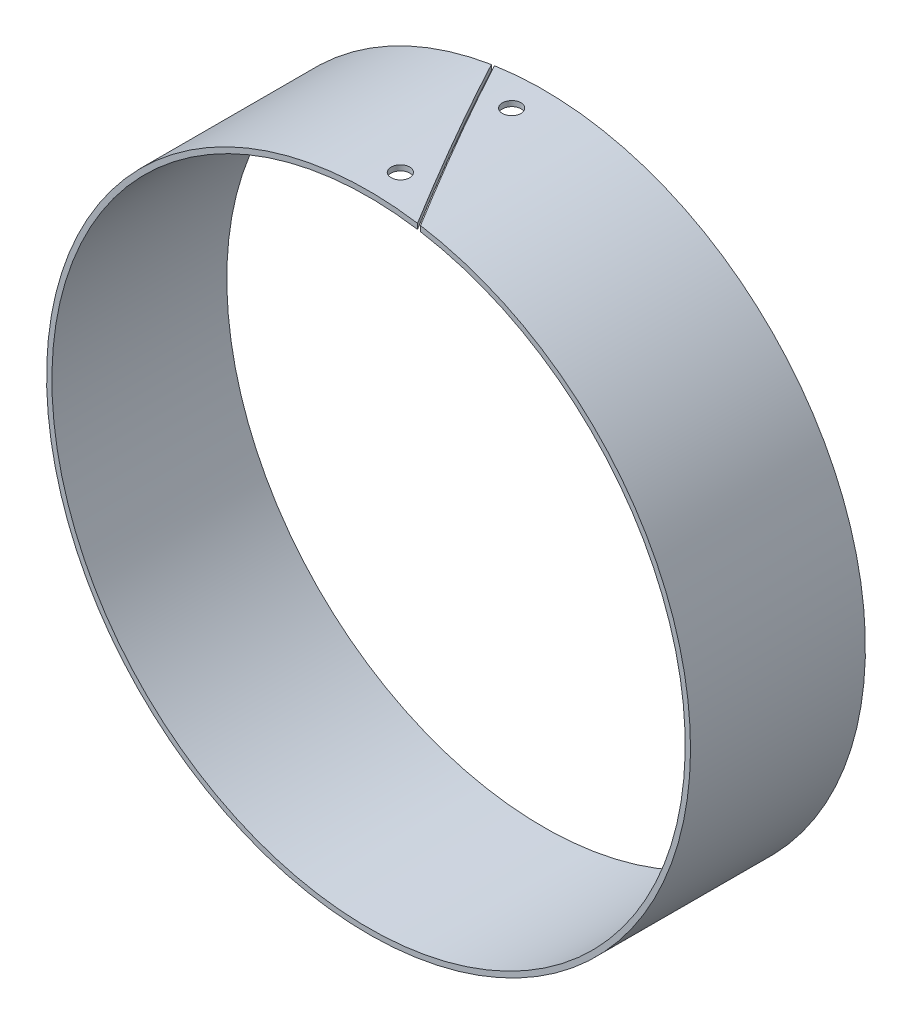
ISO-10303-21;
HEADER;
FILE_DESCRIPTION(('STEP AP214'),'2;1');
FILE_NAME('part.step','',(''),(''),'','','');
FILE_SCHEMA(('AUTOMOTIVE_DESIGN { 1 0 10303 214 1 1 1 1 }'));
ENDSEC;
DATA;
#1=APPLICATION_CONTEXT('core data for automotive mechanical design processes');
#2=APPLICATION_PROTOCOL_DEFINITION('international standard','automotive_design',2000,#1);
#3=PRODUCT_CONTEXT('',#1,'mechanical');
#4=PRODUCT('Part','Part','',(#3));
#5=PRODUCT_RELATED_PRODUCT_CATEGORY('part','',(#4));
#6=PRODUCT_DEFINITION_FORMATION('','',#4);
#7=PRODUCT_DEFINITION_CONTEXT('part definition',#1,'design');
#8=PRODUCT_DEFINITION('design','',#6,#7);
#9=PRODUCT_DEFINITION_SHAPE('','',#8);
#10=(LENGTH_UNIT() NAMED_UNIT(*) SI_UNIT(.MILLI.,.METRE.));
#11=(NAMED_UNIT(*) PLANE_ANGLE_UNIT() SI_UNIT($,.RADIAN.));
#12=(NAMED_UNIT(*) SI_UNIT($,.STERADIAN.) SOLID_ANGLE_UNIT());
#13=UNCERTAINTY_MEASURE_WITH_UNIT(LENGTH_MEASURE(1.E-05),#10,'distance_accuracy_value','');
#14=(GEOMETRIC_REPRESENTATION_CONTEXT(3) GLOBAL_UNCERTAINTY_ASSIGNED_CONTEXT((#13)) GLOBAL_UNIT_ASSIGNED_CONTEXT((#10,
#11,#12)) REPRESENTATION_CONTEXT('',''));
#15=CARTESIAN_POINT('',(0.,0.,0.));
#16=DIRECTION('',(0.,0.,1.));
#17=DIRECTION('',(1.,0.,0.));
#18=AXIS2_PLACEMENT_3D('',#15,#16,#17);
#19=CARTESIAN_POINT('',(0.,0.,32.9999999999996));
#20=DIRECTION('',(0.,0.,1.));
#21=DIRECTION('',(1.,0.,0.));
#22=AXIS2_PLACEMENT_3D('',#19,#20,#21);
#23=PLANE('',#22);
#24=DIRECTION('',(0.,1.,0.));
#25=VECTOR('',#24,1.);
#26=CARTESIAN_POINT('',(9.23520861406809,43.,33.));
#27=LINE('',#26,#25);
#28=CARTESIAN_POINT('',(9.23520861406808,59.0319694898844,33.));
#29=VERTEX_POINT('',#28);
#30=CARTESIAN_POINT('',(9.23520861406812,60.0439291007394,33.));
#31=VERTEX_POINT('',#30);
#32=EDGE_CURVE('E39',#29,#31,#27,.T.);
#33=ORIENTED_EDGE('',*,*,#32,.T.);
#34=CARTESIAN_POINT('',(0.,0.,32.9999999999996));
#35=DIRECTION('',(0.,0.,1.));
#36=DIRECTION('',(1.,0.,0.));
#37=AXIS2_PLACEMENT_3D('',#34,#35,#36);
#38=CIRCLE('',#37,60.75);
#39=CARTESIAN_POINT('',(9.81255888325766,59.9522825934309,33.));
#40=VERTEX_POINT('',#39);
#41=EDGE_CURVE('E62',#31,#40,#38,.T.);
#42=ORIENTED_EDGE('',*,*,#41,.T.);
#43=DIRECTION('',(0.,1.,0.));
#44=VECTOR('',#43,1.);
#45=CARTESIAN_POINT('',(9.81255888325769,43.,33.));
#46=LINE('',#45,#44);
#47=CARTESIAN_POINT('',(9.81255888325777,58.9387494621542,33.));
#48=VERTEX_POINT('',#47);
#49=EDGE_CURVE('E56',#48,#40,#46,.T.);
#50=ORIENTED_EDGE('',*,*,#49,.F.);
#51=CARTESIAN_POINT('',(0.,0.,32.9999999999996));
#52=DIRECTION('',(0.,0.,1.));
#53=DIRECTION('',(1.,0.,0.));
#54=AXIS2_PLACEMENT_3D('',#51,#52,#53);
#55=CIRCLE('',#54,59.75);
#56=EDGE_CURVE('E66',#29,#48,#55,.T.);
#57=ORIENTED_EDGE('',*,*,#56,.F.);
#58=EDGE_LOOP('',(#33,#42,#50,#57));
#59=FACE_BOUND('',#58,.T.);
#60=ADVANCED_FACE('F16',(#59),#23,.T.);
#61=CARTESIAN_POINT('',(0.,0.,0.));
#62=DIRECTION('',(0.,0.,1.));
#63=DIRECTION('',(1.,0.,0.));
#64=AXIS2_PLACEMENT_3D('',#61,#62,#63);
#65=PLANE('',#64);
#66=CARTESIAN_POINT('',(0.,0.,0.));
#67=DIRECTION('',(0.,0.,1.));
#68=DIRECTION('',(1.,0.,0.));
#69=AXIS2_PLACEMENT_3D('',#66,#67,#68);
#70=CIRCLE('',#69,60.75);
#71=CARTESIAN_POINT('',(-9.81735026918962,59.9514981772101,-1.38777878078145E-13));
#72=VERTEX_POINT('',#71);
#73=CARTESIAN_POINT('',(-9.24,60.0431919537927,0.));
#74=VERTEX_POINT('',#73);
#75=EDGE_CURVE('E71',#72,#74,#70,.T.);
#76=ORIENTED_EDGE('',*,*,#75,.F.);
#77=DIRECTION('',(0.,1.,0.));
#78=VECTOR('',#77,1.);
#79=CARTESIAN_POINT('',(-9.81735026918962,43.,-1.38777878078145E-13));
#80=LINE('',#79,#78);
#81=CARTESIAN_POINT('',(-9.81735026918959,58.9379515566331,-1.38777878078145E-13));
#82=VERTEX_POINT('',#81);
#83=EDGE_CURVE('E120',#82,#72,#80,.T.);
#84=ORIENTED_EDGE('',*,*,#83,.F.);
#85=CARTESIAN_POINT('',(0.,0.,0.));
#86=DIRECTION('',(0.,0.,1.));
#87=DIRECTION('',(1.,0.,0.));
#88=AXIS2_PLACEMENT_3D('',#85,#86,#87);
#89=CIRCLE('',#88,59.75);
#90=CARTESIAN_POINT('',(-9.24,59.0312197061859,0.));
#91=VERTEX_POINT('',#90);
#92=EDGE_CURVE('E72',#82,#91,#89,.T.);
#93=ORIENTED_EDGE('',*,*,#92,.T.);
#94=DIRECTION('',(0.,1.,0.));
#95=VECTOR('',#94,1.);
#96=CARTESIAN_POINT('',(-9.24,43.,0.));
#97=LINE('',#96,#95);
#98=EDGE_CURVE('E32',#91,#74,#97,.T.);
#99=ORIENTED_EDGE('',*,*,#98,.T.);
#100=EDGE_LOOP('',(#76,#84,#93,#99));
#101=FACE_BOUND('',#100,.T.);
#102=ADVANCED_FACE('F125',(#101),#65,.F.);
#103=CARTESIAN_POINT('',(0.,0.,32.9999999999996));
#104=DIRECTION('',(0.,0.,-1.));
#105=DIRECTION('',(-1.,0.,0.));
#106=AXIS2_PLACEMENT_3D('',#103,#104,#105);
#107=CYLINDRICAL_SURFACE('',#106,60.75);
#108=CARTESIAN_POINT('',(0.,60.75,7.75));
#109=CARTESIAN_POINT('',(-0.0982763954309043,60.7499996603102,7.7499956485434));
#110=CARTESIAN_POINT('',(-0.196623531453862,60.7497589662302,7.74169371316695));
#111=CARTESIAN_POINT('',(-0.390607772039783,60.7488219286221,7.70869169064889));
#112=CARTESIAN_POINT('',(-0.486241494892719,60.7481250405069,7.68397200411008));
#113=CARTESIAN_POINT('',(-0.671960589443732,60.7463545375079,7.61884012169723));
#114=CARTESIAN_POINT('',(-0.762048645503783,60.7452811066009,7.57843558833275));
#115=CARTESIAN_POINT('',(-0.934138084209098,60.7428786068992,7.48309190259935));
#116=CARTESIAN_POINT('',(-1.01614143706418,60.7415496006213,7.42815630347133));
#117=CARTESIAN_POINT('',(-1.16979435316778,60.7387849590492,7.30528195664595));
#118=CARTESIAN_POINT('',(-1.24144014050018,60.7373492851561,7.23733848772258));
#119=CARTESIAN_POINT('',(-1.37231244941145,60.734533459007,7.09038516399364));
#120=CARTESIAN_POINT('',(-1.43153847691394,60.7331533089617,7.01137486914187));
#121=CARTESIAN_POINT('',(-1.53589546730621,60.7306039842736,6.84451731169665));
#122=CARTESIAN_POINT('',(-1.58102423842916,60.7294348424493,6.7566686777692));
#123=CARTESIAN_POINT('',(-1.65589137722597,60.7274397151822,6.57463793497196));
#124=CARTESIAN_POINT('',(-1.68562980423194,60.7266137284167,6.48045585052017));
#125=CARTESIAN_POINT('',(-1.72886417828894,60.7253983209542,6.28845951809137));
#126=CARTESIAN_POINT('',(-1.74236466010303,60.7250087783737,6.19064629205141));
#127=CARTESIAN_POINT('',(-1.75275388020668,60.7247098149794,5.99414112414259));
#128=CARTESIAN_POINT('',(-1.74964268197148,60.7248003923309,5.89544918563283));
#129=CARTESIAN_POINT('',(-1.7269007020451,60.7254513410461,5.70001886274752));
#130=CARTESIAN_POINT('',(-1.70727482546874,60.7260115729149,5.60327990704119));
#131=CARTESIAN_POINT('',(-1.65206818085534,60.7275384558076,5.41447034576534));
#132=CARTESIAN_POINT('',(-1.6164873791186,60.72850510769,5.3223997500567));
#133=CARTESIAN_POINT('',(-1.5303752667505,60.7307360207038,5.14552470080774));
#134=CARTESIAN_POINT('',(-1.47984170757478,60.7320003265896,5.06072134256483));
#135=CARTESIAN_POINT('',(-1.36526022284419,60.7346839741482,4.90080005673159));
#136=CARTESIAN_POINT('',(-1.30121226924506,60.7361033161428,4.82568214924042));
#137=CARTESIAN_POINT('',(-1.16139233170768,60.7389376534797,4.6872355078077));
#138=CARTESIAN_POINT('',(-1.08561609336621,60.740352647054,4.62391107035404));
#139=CARTESIAN_POINT('',(-0.924505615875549,60.7430182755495,4.51088200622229));
#140=CARTESIAN_POINT('',(-0.839171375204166,60.7442689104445,4.46117738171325));
#141=CARTESIAN_POINT('',(-0.661364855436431,60.7464648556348,4.37679937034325));
#142=CARTESIAN_POINT('',(-0.568892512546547,60.7474101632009,4.34212611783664));
#143=CARTESIAN_POINT('',(-0.379435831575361,60.7488888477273,4.28879784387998));
#144=CARTESIAN_POINT('',(-0.282451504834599,60.7494222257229,4.27014278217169));
#145=CARTESIAN_POINT('',(-0.0867612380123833,60.7500167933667,4.24938570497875));
#146=CARTESIAN_POINT('',(0.0119440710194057,60.7500781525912,4.24727774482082));
#147=CARTESIAN_POINT('',(0.208307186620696,60.7497222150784,4.25965921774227));
#148=CARTESIAN_POINT('',(0.305964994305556,60.7493049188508,4.27414863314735));
#149=CARTESIAN_POINT('',(0.497444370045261,60.7480388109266,4.31930863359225));
#150=CARTESIAN_POINT('',(0.591266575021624,60.7471900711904,4.34997652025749));
#151=CARTESIAN_POINT('',(0.772431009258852,60.7451567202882,4.42662016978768));
#152=CARTESIAN_POINT('',(0.859773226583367,60.7439721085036,4.47259596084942));
#153=CARTESIAN_POINT('',(1.02552571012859,60.7414000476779,4.57856563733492));
#154=CARTESIAN_POINT('',(1.10393341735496,60.7400125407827,4.63856352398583));
#155=CARTESIAN_POINT('',(1.24956546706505,60.7371912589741,4.7708683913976));
#156=CARTESIAN_POINT('',(1.31678978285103,60.7357574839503,4.84317540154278));
#157=CARTESIAN_POINT('',(1.43816662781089,60.7330048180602,4.99807144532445));
#158=CARTESIAN_POINT('',(1.49231532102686,60.7316859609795,5.08066348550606));
#159=CARTESIAN_POINT('',(1.58597759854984,60.7293123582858,5.25376973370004));
#160=CARTESIAN_POINT('',(1.62549121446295,60.7282576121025,5.3442839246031));
#161=CARTESIAN_POINT('',(1.68875497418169,60.7265313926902,5.53065065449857));
#162=CARTESIAN_POINT('',(1.71250760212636,60.7258598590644,5.6265023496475));
#163=CARTESIAN_POINT('',(1.74358328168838,60.7249756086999,5.82083518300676));
#164=CARTESIAN_POINT('',(1.75090634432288,60.7247628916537,5.91931631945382));
#165=CARTESIAN_POINT('',(1.74891472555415,60.7248202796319,6.11607407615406));
#166=CARTESIAN_POINT('',(1.73960609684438,60.7250902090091,6.21435075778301));
#167=CARTESIAN_POINT('',(1.70462777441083,60.7260820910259,6.40794582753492));
#168=CARTESIAN_POINT('',(1.67895804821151,60.7268040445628,6.50326420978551));
#169=CARTESIAN_POINT('',(1.61198698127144,60.7286185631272,6.68823938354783));
#170=CARTESIAN_POINT('',(1.5706853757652,60.7297111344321,6.77789607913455));
#171=CARTESIAN_POINT('',(1.47362518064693,60.7321436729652,6.94900091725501));
#172=CARTESIAN_POINT('',(1.41786711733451,60.7334836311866,7.03044935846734));
#173=CARTESIAN_POINT('',(1.29345950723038,60.7362603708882,7.18285313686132));
#174=CARTESIAN_POINT('',(1.22480664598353,60.7376971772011,7.25380576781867));
#175=CARTESIAN_POINT('',(1.07654357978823,60.7405057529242,7.38319767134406));
#176=CARTESIAN_POINT('',(0.996930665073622,60.7418775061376,7.44163384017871));
#177=CARTESIAN_POINT('',(0.828977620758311,60.7444017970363,7.54434320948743));
#178=CARTESIAN_POINT('',(0.74063198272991,60.7455541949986,7.58860739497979));
#179=CARTESIAN_POINT('',(0.557828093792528,60.7475073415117,7.66162359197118));
#180=CARTESIAN_POINT('',(0.463377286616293,60.7483085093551,7.69039410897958));
#181=CARTESIAN_POINT('',(0.306941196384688,60.7492547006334,7.723978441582));
#182=CARTESIAN_POINT('',(0.245971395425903,60.7495329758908,7.73372425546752));
#183=CARTESIAN_POINT('',(0.123343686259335,60.7499057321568,7.74673639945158));
#184=CARTESIAN_POINT('',(0.0616857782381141,60.7500002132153,7.7500027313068));
#185=CARTESIAN_POINT('',(0.,60.75,7.75));
#186=B_SPLINE_CURVE_WITH_KNOTS('',3,(#108,#109,#110,#111,#112,#113,#114,#115,#116,#117,#118,
#119,#120,#121,#122,#123,#124,#125,#126,#127,#128,#129,#130,#131,#132,#133,#134,#135,#136,#137,
#138,#139,#140,#141,#142,#143,#144,#145,#146,#147,#148,#149,#150,#151,#152,#153,#154,#155,#156,
#157,#158,#159,#160,#161,#162,#163,#164,#165,#166,#167,#168,#169,#170,#171,#172,#173,#174,#175,
#176,#177,#178,#179,#180,#181,#182,#183,#184,#185),.UNSPECIFIED.,.T.,.F.,(4,2,2,2,2,2,2,2,2,2,2,
2,2,2,2,2,2,2,2,2,2,2,2,2,2,2,2,2,2,2,2,2,2,2,2,2,2,2,4),(0.,0.294604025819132,
0.589560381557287,0.88437282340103,1.17911324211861,1.47396084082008,1.76882016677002,
2.06372531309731,2.35862932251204,2.6534509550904,2.94827146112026,3.24300443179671,
3.53773802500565,3.83251596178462,4.12729451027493,4.42218024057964,4.71706601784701,
5.01195443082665,5.306842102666,5.60162382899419,5.89640524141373,6.19113750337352,
6.48587030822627,6.78068731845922,7.07550503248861,7.3704091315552,7.66531259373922,
7.96016956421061,8.25502633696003,8.54977582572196,8.84452589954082,9.13928096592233,
9.43402530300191,9.72884550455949,10.0237387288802,10.318819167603,10.6135463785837,
10.7984624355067,10.983378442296),.UNSPECIFIED.);
#187=CARTESIAN_POINT('',(0.,60.75,7.75));
#188=VERTEX_POINT('',#187);
#189=EDGE_CURVE('E91',#188,#188,#186,.T.);
#190=ORIENTED_EDGE('',*,*,#189,.T.);
#191=EDGE_LOOP('',(#190));
#192=FACE_BOUND('',#191,.T.);
#193=CARTESIAN_POINT('',(0.,60.75,28.75));
#194=CARTESIAN_POINT('',(-0.0982763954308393,60.7499996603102,28.7499956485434));
#195=CARTESIAN_POINT('',(-0.196623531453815,60.7497589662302,28.741693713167));
#196=CARTESIAN_POINT('',(-0.390607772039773,60.7488219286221,28.7086916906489));
#197=CARTESIAN_POINT('',(-0.486241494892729,60.7481250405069,28.6839720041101));
#198=CARTESIAN_POINT('',(-0.67196058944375,60.7463545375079,28.6188401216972));
#199=CARTESIAN_POINT('',(-0.762048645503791,60.7452811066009,28.5784355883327));
#200=CARTESIAN_POINT('',(-0.934138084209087,60.7428786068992,28.4830919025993));
#201=CARTESIAN_POINT('',(-1.01614143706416,60.7415496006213,28.4281563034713));
#202=CARTESIAN_POINT('',(-1.16979435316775,60.7387849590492,28.305281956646));
#203=CARTESIAN_POINT('',(-1.24144014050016,60.7373492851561,28.2373384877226));
#204=CARTESIAN_POINT('',(-1.37231244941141,60.734533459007,28.0903851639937));
#205=CARTESIAN_POINT('',(-1.43153847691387,60.7331533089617,28.0113748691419));
#206=CARTESIAN_POINT('',(-1.53589546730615,60.7306039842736,27.8445173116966));
#207=CARTESIAN_POINT('',(-1.58102423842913,60.7294348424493,27.7566686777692));
#208=CARTESIAN_POINT('',(-1.65589137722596,60.7274397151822,27.574637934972));
#209=CARTESIAN_POINT('',(-1.68562980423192,60.7266137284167,27.4804558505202));
#210=CARTESIAN_POINT('',(-1.72886417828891,60.7253983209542,27.2884595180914));
#211=CARTESIAN_POINT('',(-1.74236466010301,60.7250087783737,27.1906462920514));
#212=CARTESIAN_POINT('',(-1.75275388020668,60.7247098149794,26.9941411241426));
#213=CARTESIAN_POINT('',(-1.7496426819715,60.7248003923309,26.8954491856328));
#214=CARTESIAN_POINT('',(-1.72690070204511,60.7254513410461,26.7000188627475));
#215=CARTESIAN_POINT('',(-1.70727482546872,60.7260115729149,26.6032799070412));
#216=CARTESIAN_POINT('',(-1.65206818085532,60.7275384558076,26.4144703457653));
#217=CARTESIAN_POINT('',(-1.61648737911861,60.72850510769,26.3223997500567));
#218=CARTESIAN_POINT('',(-1.5303752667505,60.7307360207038,26.1455247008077));
#219=CARTESIAN_POINT('',(-1.47984170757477,60.7320003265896,26.0607213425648));
#220=CARTESIAN_POINT('',(-1.36526022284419,60.7346839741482,25.9008000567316));
#221=CARTESIAN_POINT('',(-1.30121226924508,60.7361033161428,25.8256821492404));
#222=CARTESIAN_POINT('',(-1.16139233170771,60.7389376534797,25.6872355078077));
#223=CARTESIAN_POINT('',(-1.08561609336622,60.740352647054,25.6239110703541));
#224=CARTESIAN_POINT('',(-0.924505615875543,60.7430182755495,25.5108820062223));
#225=CARTESIAN_POINT('',(-0.839171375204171,60.7442689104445,25.4611773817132));
#226=CARTESIAN_POINT('',(-0.661364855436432,60.7464648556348,25.3767993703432));
#227=CARTESIAN_POINT('',(-0.568892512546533,60.7474101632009,25.3421261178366));
#228=CARTESIAN_POINT('',(-0.379435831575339,60.7488888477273,25.28879784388));
#229=CARTESIAN_POINT('',(-0.282451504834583,60.7494222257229,25.2701427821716));
#230=CARTESIAN_POINT('',(-0.086761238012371,60.7500167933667,25.2493857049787));
#231=CARTESIAN_POINT('',(0.0119440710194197,60.7500781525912,25.2472777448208));
#232=CARTESIAN_POINT('',(0.208307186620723,60.7497222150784,25.2596592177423));
#233=CARTESIAN_POINT('',(0.305964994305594,60.7493049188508,25.2741486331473));
#234=CARTESIAN_POINT('',(0.497444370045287,60.7480388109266,25.3193086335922));
#235=CARTESIAN_POINT('',(0.591266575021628,60.7471900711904,25.3499765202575));
#236=CARTESIAN_POINT('',(0.772431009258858,60.7451567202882,25.4266201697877));
#237=CARTESIAN_POINT('',(0.859773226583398,60.7439721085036,25.4725959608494));
#238=CARTESIAN_POINT('',(1.02552571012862,60.7414000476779,25.5785656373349));
#239=CARTESIAN_POINT('',(1.10393341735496,60.7400125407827,25.6385635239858));
#240=CARTESIAN_POINT('',(1.24956546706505,60.7371912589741,25.7708683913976));
#241=CARTESIAN_POINT('',(1.31678978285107,60.7357574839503,25.8431754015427));
#242=CARTESIAN_POINT('',(1.43816662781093,60.7330048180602,25.9980714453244));
#243=CARTESIAN_POINT('',(1.49231532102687,60.7316859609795,26.080663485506));
#244=CARTESIAN_POINT('',(1.58597759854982,60.7293123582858,26.2537697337));
#245=CARTESIAN_POINT('',(1.62549121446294,60.7282576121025,26.3442839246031));
#246=CARTESIAN_POINT('',(1.6887549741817,60.7265313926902,26.5306506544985));
#247=CARTESIAN_POINT('',(1.71250760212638,60.7258598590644,26.6265023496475));
#248=CARTESIAN_POINT('',(1.74358328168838,60.7249756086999,26.8208351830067));
#249=CARTESIAN_POINT('',(1.75090634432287,60.7247628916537,26.9193163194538));
#250=CARTESIAN_POINT('',(1.74891472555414,60.7248202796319,27.116074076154));
#251=CARTESIAN_POINT('',(1.7396060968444,60.7250902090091,27.214350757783));
#252=CARTESIAN_POINT('',(1.70462777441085,60.7260820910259,27.4079458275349));
#253=CARTESIAN_POINT('',(1.67895804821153,60.7268040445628,27.5032642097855));
#254=CARTESIAN_POINT('',(1.61198698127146,60.7286185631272,27.6882393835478));
#255=CARTESIAN_POINT('',(1.57068537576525,60.7297111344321,27.7778960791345));
#256=CARTESIAN_POINT('',(1.47362518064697,60.7321436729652,27.9490009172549));
#257=CARTESIAN_POINT('',(1.41786711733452,60.7334836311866,28.0304493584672));
#258=CARTESIAN_POINT('',(1.29345950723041,60.7362603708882,28.1828531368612));
#259=CARTESIAN_POINT('',(1.22480664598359,60.7376971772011,28.2538057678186));
#260=CARTESIAN_POINT('',(1.07654357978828,60.7405057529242,28.383197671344));
#261=CARTESIAN_POINT('',(0.996930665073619,60.7418775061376,28.4416338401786));
#262=CARTESIAN_POINT('',(0.828977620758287,60.7444017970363,28.5443432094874));
#263=CARTESIAN_POINT('',(0.740631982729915,60.7455541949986,28.5886073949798));
#264=CARTESIAN_POINT('',(0.55782809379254,60.7475073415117,28.6616235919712));
#265=CARTESIAN_POINT('',(0.46337728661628,60.7483085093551,28.6903941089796));
#266=CARTESIAN_POINT('',(0.306941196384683,60.7492547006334,28.723978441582));
#267=CARTESIAN_POINT('',(0.245971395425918,60.7495329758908,28.7337242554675));
#268=CARTESIAN_POINT('',(0.123343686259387,60.7499057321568,28.7467363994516));
#269=CARTESIAN_POINT('',(0.0616857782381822,60.7500002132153,28.7500027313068));
#270=CARTESIAN_POINT('',(0.,60.75,28.75));
#271=B_SPLINE_CURVE_WITH_KNOTS('',3,(#193,#194,#195,#196,#197,#198,#199,#200,#201,#202,#203,
#204,#205,#206,#207,#208,#209,#210,#211,#212,#213,#214,#215,#216,#217,#218,#219,#220,#221,#222,
#223,#224,#225,#226,#227,#228,#229,#230,#231,#232,#233,#234,#235,#236,#237,#238,#239,#240,#241,
#242,#243,#244,#245,#246,#247,#248,#249,#250,#251,#252,#253,#254,#255,#256,#257,#258,#259,#260,
#261,#262,#263,#264,#265,#266,#267,#268,#269,#270),.UNSPECIFIED.,.T.,.F.,(4,2,2,2,2,2,2,2,2,2,2,
2,2,2,2,2,2,2,2,2,2,2,2,2,2,2,2,2,2,2,2,2,2,2,2,2,2,2,4),(0.,0.294604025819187,
0.589560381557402,0.884372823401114,1.17911324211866,1.47396084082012,1.76882016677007,
2.06372531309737,2.3586293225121,2.65345095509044,2.9482714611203,3.24300443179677,
3.53773802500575,3.83251596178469,4.12729451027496,4.4221802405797,4.71706601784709,
5.01195443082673,5.30684210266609,5.60162382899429,5.89640524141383,6.19113750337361,
6.48587030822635,6.78068731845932,7.07550503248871,7.37040913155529,7.6653125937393,
7.96016956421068,8.25502633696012,8.54977582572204,8.84452589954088,9.13928096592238,
9.43402530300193,9.72884550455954,10.0237387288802,10.3188191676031,10.6135463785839,
10.7984624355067,10.9833784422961),.UNSPECIFIED.);
#272=CARTESIAN_POINT('',(0.,60.75,28.75));
#273=VERTEX_POINT('',#272);
#274=EDGE_CURVE('E76',#273,#273,#271,.T.);
#275=ORIENTED_EDGE('',*,*,#274,.T.);
#276=EDGE_LOOP('',(#275));
#277=FACE_BOUND('',#276,.T.);
#278=ORIENTED_EDGE('',*,*,#41,.F.);
#279=CARTESIAN_POINT('',(0.,0.,17.0041494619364));
#280=DIRECTION('',(-0.866025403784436,0.,0.5));
#281=DIRECTION('',(-0.5,0.,-0.866025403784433));
#282=AXIS2_PLACEMENT_3D('',#279,#280,#281);
#283=ELLIPSE('',#282,121.5,60.75);
#284=EDGE_CURVE('E114',#31,#72,#283,.T.);
#285=ORIENTED_EDGE('',*,*,#284,.T.);
#286=ORIENTED_EDGE('',*,*,#75,.T.);
#287=CARTESIAN_POINT('',(0.,0.,16.0041494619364));
#288=DIRECTION('',(0.866025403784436,0.,-0.5));
#289=DIRECTION('',(-0.5,0.,-0.866025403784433));
#290=AXIS2_PLACEMENT_3D('',#287,#288,#289);
#291=ELLIPSE('',#290,121.5,60.75);
#292=EDGE_CURVE('E117',#74,#40,#291,.T.);
#293=ORIENTED_EDGE('',*,*,#292,.T.);
#294=EDGE_LOOP('',(#278,#285,#286,#293));
#295=FACE_BOUND('',#294,.T.);
#296=ADVANCED_FACE('F18',(#192,#277,#295),#107,.T.);
#297=CARTESIAN_POINT('',(0.,0.,32.9999999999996));
#298=DIRECTION('',(0.,0.,-1.));
#299=DIRECTION('',(-1.,0.,0.));
#300=AXIS2_PLACEMENT_3D('',#297,#298,#299);
#301=CYLINDRICAL_SURFACE('',#300,59.75);
#302=CARTESIAN_POINT('',(0.,0.,17.0041494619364));
#303=DIRECTION('',(-0.866025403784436,0.,0.5));
#304=DIRECTION('',(-0.5,0.,-0.866025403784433));
#305=AXIS2_PLACEMENT_3D('',#302,#303,#304);
#306=ELLIPSE('',#305,119.5,59.75);
#307=EDGE_CURVE('E11',#29,#82,#306,.T.);
#308=ORIENTED_EDGE('',*,*,#307,.F.);
#309=ORIENTED_EDGE('',*,*,#56,.T.);
#310=CARTESIAN_POINT('',(0.,0.,16.0041494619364));
#311=DIRECTION('',(0.866025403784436,0.,-0.5));
#312=DIRECTION('',(-0.5,0.,-0.866025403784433));
#313=AXIS2_PLACEMENT_3D('',#310,#311,#312);
#314=ELLIPSE('',#313,119.5,59.75);
#315=EDGE_CURVE('E25',#91,#48,#314,.T.);
#316=ORIENTED_EDGE('',*,*,#315,.F.);
#317=ORIENTED_EDGE('',*,*,#92,.F.);
#318=EDGE_LOOP('',(#308,#309,#316,#317));
#319=FACE_BOUND('',#318,.T.);
#320=CARTESIAN_POINT('',(0.,59.75,7.75));
#321=CARTESIAN_POINT('',(-0.0982756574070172,59.7499996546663,7.74999564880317));
#322=CARTESIAN_POINT('',(-0.196622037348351,59.7497549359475,7.74169383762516));
#323=CARTESIAN_POINT('',(-0.390604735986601,59.7488022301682,7.70869233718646));
#324=CARTESIAN_POINT('',(-0.486237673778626,59.7480936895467,7.68397305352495));
#325=CARTESIAN_POINT('',(-0.671955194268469,59.7462935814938,7.61884230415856));
#326=CARTESIAN_POINT('',(-0.76204246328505,59.7452022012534,7.57843850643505));
#327=CARTESIAN_POINT('',(-0.934130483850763,59.7427595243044,7.48309662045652));
#328=CARTESIAN_POINT('',(-1.01613320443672,59.7414082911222,7.42816208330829));
#329=CARTESIAN_POINT('',(-1.16978581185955,59.7385973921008,7.3052895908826));
#330=CARTESIAN_POINT('',(-1.24143183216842,59.7371376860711,7.23734680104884));
#331=CARTESIAN_POINT('',(-1.3723047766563,59.7342747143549,7.09039479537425));
#332=CARTESIAN_POINT('',(-1.43153120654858,59.7328714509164,7.01138513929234));
#333=CARTESIAN_POINT('',(-1.5358894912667,59.730279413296,6.84452822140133));
#334=CARTESIAN_POINT('',(-1.58101907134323,59.729090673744,6.75667953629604));
#335=CARTESIAN_POINT('',(-1.65588776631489,59.7270620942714,6.57464841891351));
#336=CARTESIAN_POINT('',(-1.68562694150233,59.7262222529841,6.48046601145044));
#337=CARTESIAN_POINT('',(-1.72886245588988,59.7249864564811,6.28846971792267));
#338=CARTESIAN_POINT('',(-1.742363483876,59.724590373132,6.19065688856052));
#339=CARTESIAN_POINT('',(-1.7527539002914,59.7242863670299,5.99415239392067));
#340=CARTESIAN_POINT('',(-1.74964335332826,59.7243784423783,5.89546073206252));
#341=CARTESIAN_POINT('',(-1.72690288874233,59.7250402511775,5.70003187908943));
#342=CARTESIAN_POINT('',(-1.70727804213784,59.7256098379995,5.6032940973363));
#343=CARTESIAN_POINT('',(-1.65207389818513,59.7271622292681,5.41448671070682));
#344=CARTESIAN_POINT('',(-1.61649456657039,59.7281450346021,5.32241711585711));
#345=CARTESIAN_POINT('',(-1.53038560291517,59.7304132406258,5.14554332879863));
#346=CARTESIAN_POINT('',(-1.47985364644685,59.7316986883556,5.06074026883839));
#347=CARTESIAN_POINT('',(-1.36527558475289,59.7344272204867,4.90081923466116));
#348=CARTESIAN_POINT('',(-1.30122945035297,59.7358703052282,4.82570128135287));
#349=CARTESIAN_POINT('',(-1.16141238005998,59.7387520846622,4.68725323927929));
#350=CARTESIAN_POINT('',(-1.08563704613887,59.7401907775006,4.6239275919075));
#351=CARTESIAN_POINT('',(-0.924528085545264,59.7429010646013,4.51089594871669));
#352=CARTESIAN_POINT('',(-0.839194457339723,59.7441726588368,4.46118995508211));
#353=CARTESIAN_POINT('',(-0.661388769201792,59.7464054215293,4.37680909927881));
#354=CARTESIAN_POINT('',(-0.568916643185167,59.7473665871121,4.34213437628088));
#355=CARTESIAN_POINT('',(-0.379460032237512,59.7488700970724,4.28880319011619));
#356=CARTESIAN_POINT('',(-0.282475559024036,59.7494124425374,4.27014668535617));
#357=CARTESIAN_POINT('',(-0.0867858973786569,59.7500170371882,4.24938696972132));
#358=CARTESIAN_POINT('',(0.0119186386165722,59.7500794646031,4.24727761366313));
#359=CARTESIAN_POINT('',(0.208280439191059,59.7497176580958,4.25965605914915));
#360=CARTESIAN_POINT('',(0.305937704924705,59.7492934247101,4.27414384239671));
#361=CARTESIAN_POINT('',(0.497415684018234,59.7480062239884,4.31930022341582));
#362=CARTESIAN_POINT('',(0.591237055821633,59.747143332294,4.34996603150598));
#363=CARTESIAN_POINT('',(0.772400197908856,59.7450760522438,4.42660513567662));
#364=CARTESIAN_POINT('',(0.859741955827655,59.7438716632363,4.47257846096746));
#365=CARTESIAN_POINT('',(1.02549483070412,59.7412566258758,4.57854340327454));
#366=CARTESIAN_POINT('',(1.10390330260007,59.7398459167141,4.63853915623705));
#367=CARTESIAN_POINT('',(1.24953730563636,59.7369774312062,4.77083981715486));
#368=CARTESIAN_POINT('',(1.31676280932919,59.7355196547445,4.843144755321));
#369=CARTESIAN_POINT('',(1.43814309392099,59.7327208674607,4.99803763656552));
#370=CARTESIAN_POINT('',(1.49229390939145,59.7313798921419,5.08062868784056));
#371=CARTESIAN_POINT('',(1.58596055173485,59.7289664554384,5.2537334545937));
#372=CARTESIAN_POINT('',(1.6254764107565,59.727893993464,5.3442471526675));
#373=CARTESIAN_POINT('',(1.68874448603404,59.7261387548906,5.53061292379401));
#374=CARTESIAN_POINT('',(1.71249926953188,59.7254559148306,5.62646412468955));
#375=CARTESIAN_POINT('',(1.74357930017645,59.7245567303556,5.82079640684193));
#376=CARTESIAN_POINT('',(1.75090455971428,59.7243403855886,5.91927748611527));
#377=CARTESIAN_POINT('',(1.74891730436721,59.7243986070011,6.11603428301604));
#378=CARTESIAN_POINT('',(1.73961104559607,59.7246729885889,6.21431006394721));
#379=CARTESIAN_POINT('',(1.70463778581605,59.7256813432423,6.40790371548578));
#380=CARTESIAN_POINT('',(1.67897075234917,59.7264153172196,6.50322158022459));
#381=CARTESIAN_POINT('',(1.6120053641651,59.7282600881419,6.6881961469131));
#382=CARTESIAN_POINT('',(1.57070674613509,59.7293708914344,6.77785275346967));
#383=CARTESIAN_POINT('',(1.47365274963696,59.7318440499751,6.94895796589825));
#384=CARTESIAN_POINT('',(1.41789789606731,59.7332063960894,7.03040686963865));
#385=CARTESIAN_POINT('',(1.29349603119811,59.7360295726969,7.18281317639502));
#386=CARTESIAN_POINT('',(1.22484554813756,59.7374904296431,7.25376774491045));
#387=CARTESIAN_POINT('',(1.07658688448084,59.7403460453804,7.38316394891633));
#388=CARTESIAN_POINT('',(0.996975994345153,59.7417407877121,7.44160248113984));
#389=CARTESIAN_POINT('',(0.829026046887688,59.7443074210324,7.54431723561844));
#390=CARTESIAN_POINT('',(0.740681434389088,59.745479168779,7.58858436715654));
#391=CARTESIAN_POINT('',(0.557878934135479,59.7474651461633,7.66160655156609));
#392=CARTESIAN_POINT('',(0.463428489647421,59.7482798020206,7.69038010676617));
#393=CARTESIAN_POINT('',(0.306984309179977,59.7492420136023,7.72397107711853));
#394=CARTESIAN_POINT('',(0.246006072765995,59.7495250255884,7.73371964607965));
#395=CARTESIAN_POINT('',(0.123361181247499,59.7499041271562,7.74673547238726));
#396=CARTESIAN_POINT('',(0.0616945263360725,59.7500002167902,7.75000273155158));
#397=CARTESIAN_POINT('',(0.,59.75,7.75));
#398=B_SPLINE_CURVE_WITH_KNOTS('',3,(#320,#321,#322,#323,#324,#325,#326,#327,#328,#329,#330,
#331,#332,#333,#334,#335,#336,#337,#338,#339,#340,#341,#342,#343,#344,#345,#346,#347,#348,#349,
#350,#351,#352,#353,#354,#355,#356,#357,#358,#359,#360,#361,#362,#363,#364,#365,#366,#367,#368,
#369,#370,#371,#372,#373,#374,#375,#376,#377,#378,#379,#380,#381,#382,#383,#384,#385,#386,#387,
#388,#389,#390,#391,#392,#393,#394,#395,#396,#397),.UNSPECIFIED.,.T.,.F.,(4,2,2,2,2,2,2,2,2,2,2,
2,2,2,2,2,2,2,2,2,2,2,2,2,2,2,2,2,2,2,2,2,2,2,2,2,2,2,4),(0.,0.294601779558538,
0.589555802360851,0.884365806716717,1.17910383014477,1.4739516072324,1.76881111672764,
2.06371818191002,2.35862409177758,2.65344482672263,2.94826441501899,3.2429935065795,
3.53772323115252,3.83249879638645,4.12727499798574,4.42216199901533,4.71704904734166,
5.01193882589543,5.30682783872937,5.60160733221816,5.89638650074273,6.1911148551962,
6.4858437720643,6.78065972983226,7.07547641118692,7.37038239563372,7.66528773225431,
7.96014502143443,8.25500208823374,8.54974826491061,8.84449502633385,9.13924675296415,
9.43398777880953,9.72880826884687,10.023701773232,10.3187840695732,10.6135131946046,
10.7984554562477,10.9833976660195),.UNSPECIFIED.);
#399=CARTESIAN_POINT('',(0.,59.75,7.75));
#400=VERTEX_POINT('',#399);
#401=EDGE_CURVE('E92',#400,#400,#398,.T.);
#402=ORIENTED_EDGE('',*,*,#401,.F.);
#403=EDGE_LOOP('',(#402));
#404=FACE_BOUND('',#403,.T.);
#405=CARTESIAN_POINT('',(0.,59.75,28.75));
#406=CARTESIAN_POINT('',(-0.0982756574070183,59.7499996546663,28.7499956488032));
#407=CARTESIAN_POINT('',(-0.19662203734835,59.7497549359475,28.7416938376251));
#408=CARTESIAN_POINT('',(-0.390604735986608,59.7488022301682,28.7086923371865));
#409=CARTESIAN_POINT('',(-0.486237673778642,59.7480936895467,28.683973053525));
#410=CARTESIAN_POINT('',(-0.671955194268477,59.7462935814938,28.6188423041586));
#411=CARTESIAN_POINT('',(-0.76204246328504,59.7452022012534,28.5784385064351));
#412=CARTESIAN_POINT('',(-0.93413048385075,59.7427595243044,28.4830966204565));
#413=CARTESIAN_POINT('',(-1.01613320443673,59.7414082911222,28.4281620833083));
#414=CARTESIAN_POINT('',(-1.16978581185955,59.7385973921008,28.3052895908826));
#415=CARTESIAN_POINT('',(-1.2414318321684,59.7371376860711,28.2373468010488));
#416=CARTESIAN_POINT('',(-1.37230477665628,59.7342747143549,28.0903947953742));
#417=CARTESIAN_POINT('',(-1.43153120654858,59.7328714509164,28.0113851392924));
#418=CARTESIAN_POINT('',(-1.5358894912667,59.730279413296,27.8445282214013));
#419=CARTESIAN_POINT('',(-1.58101907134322,59.729090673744,27.756679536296));
#420=CARTESIAN_POINT('',(-1.65588776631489,59.7270620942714,27.5746484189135));
#421=CARTESIAN_POINT('',(-1.68562694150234,59.7262222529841,27.4804660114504));
#422=CARTESIAN_POINT('',(-1.72886245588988,59.7249864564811,27.2884697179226));
#423=CARTESIAN_POINT('',(-1.742363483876,59.724590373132,27.1906568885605));
#424=CARTESIAN_POINT('',(-1.75275390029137,59.7242863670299,26.9941523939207));
#425=CARTESIAN_POINT('',(-1.74964335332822,59.7243784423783,26.8954607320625));
#426=CARTESIAN_POINT('',(-1.7269028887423,59.7250402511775,26.7000318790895));
#427=CARTESIAN_POINT('',(-1.70727804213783,59.7256098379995,26.6032940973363));
#428=CARTESIAN_POINT('',(-1.65207389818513,59.7271622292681,26.4144867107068));
#429=CARTESIAN_POINT('',(-1.61649456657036,59.7281450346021,26.3224171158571));
#430=CARTESIAN_POINT('',(-1.53038560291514,59.7304132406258,26.1455433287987));
#431=CARTESIAN_POINT('',(-1.47985364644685,59.7316986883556,26.0607402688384));
#432=CARTESIAN_POINT('',(-1.3652755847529,59.7344272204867,25.9008192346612));
#433=CARTESIAN_POINT('',(-1.30122945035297,59.7358703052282,25.8257012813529));
#434=CARTESIAN_POINT('',(-1.16141238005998,59.7387520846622,25.6872532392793));
#435=CARTESIAN_POINT('',(-1.08563704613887,59.7401907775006,25.6239275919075));
#436=CARTESIAN_POINT('',(-0.92452808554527,59.7429010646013,25.5108959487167));
#437=CARTESIAN_POINT('',(-0.83919445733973,59.7441726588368,25.4611899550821));
#438=CARTESIAN_POINT('',(-0.661388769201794,59.7464054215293,25.3768090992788));
#439=CARTESIAN_POINT('',(-0.568916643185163,59.7473665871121,25.3421343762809));
#440=CARTESIAN_POINT('',(-0.379460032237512,59.7488700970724,25.2888031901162));
#441=CARTESIAN_POINT('',(-0.282475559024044,59.7494124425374,25.2701466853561));
#442=CARTESIAN_POINT('',(-0.0867858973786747,59.7500170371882,25.2493869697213));
#443=CARTESIAN_POINT('',(0.0119186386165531,59.7500794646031,25.2472776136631));
#444=CARTESIAN_POINT('',(0.208280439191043,59.7497176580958,25.2596560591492));
#445=CARTESIAN_POINT('',(0.305937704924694,59.7492934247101,25.2741438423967));
#446=CARTESIAN_POINT('',(0.497415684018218,59.7480062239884,25.3193002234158));
#447=CARTESIAN_POINT('',(0.591237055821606,59.747143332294,25.349966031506));
#448=CARTESIAN_POINT('',(0.772400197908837,59.7450760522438,25.4266051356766));
#449=CARTESIAN_POINT('',(0.859741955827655,59.7438716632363,25.4725784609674));
#450=CARTESIAN_POINT('',(1.02549483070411,59.7412566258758,25.5785434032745));
#451=CARTESIAN_POINT('',(1.10390330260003,59.7398459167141,25.638539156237));
#452=CARTESIAN_POINT('',(1.2495373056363,59.7369774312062,25.7708398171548));
#453=CARTESIAN_POINT('',(1.31676280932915,59.7355196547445,25.8431447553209));
#454=CARTESIAN_POINT('',(1.43814309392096,59.7327208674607,25.9980376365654));
#455=CARTESIAN_POINT('',(1.49229390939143,59.7313798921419,26.0806286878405));
#456=CARTESIAN_POINT('',(1.58596055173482,59.7289664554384,26.2537334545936));
#457=CARTESIAN_POINT('',(1.62547641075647,59.727893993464,26.3442471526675));
#458=CARTESIAN_POINT('',(1.68874448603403,59.7261387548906,26.530612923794));
#459=CARTESIAN_POINT('',(1.71249926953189,59.7254559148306,26.6264641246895));
#460=CARTESIAN_POINT('',(1.74357930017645,59.7245567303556,26.8207964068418));
#461=CARTESIAN_POINT('',(1.75090455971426,59.7243403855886,26.9192774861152));
#462=CARTESIAN_POINT('',(1.74891730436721,59.7243986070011,27.1160342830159));
#463=CARTESIAN_POINT('',(1.7396110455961,59.7246729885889,27.2143100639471));
#464=CARTESIAN_POINT('',(1.70463778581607,59.7256813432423,27.4079037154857));
#465=CARTESIAN_POINT('',(1.67897075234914,59.7264153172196,27.5032215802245));
#466=CARTESIAN_POINT('',(1.61200536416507,59.7282600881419,27.688196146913));
#467=CARTESIAN_POINT('',(1.57070674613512,59.7293708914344,27.7778527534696));
#468=CARTESIAN_POINT('',(1.473652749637,59.7318440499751,27.9489579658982));
#469=CARTESIAN_POINT('',(1.41789789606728,59.7332063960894,28.0304068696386));
#470=CARTESIAN_POINT('',(1.29349603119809,59.7360295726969,28.182813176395));
#471=CARTESIAN_POINT('',(1.2248455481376,59.7374904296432,28.2537677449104));
#472=CARTESIAN_POINT('',(1.07658688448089,59.7403460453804,28.3831639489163));
#473=CARTESIAN_POINT('',(0.996975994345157,59.7417407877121,28.4416024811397));
#474=CARTESIAN_POINT('',(0.829026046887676,59.7443074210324,28.5443172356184));
#475=CARTESIAN_POINT('',(0.740681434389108,59.745479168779,28.5885843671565));
#476=CARTESIAN_POINT('',(0.557878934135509,59.7474651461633,28.6616065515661));
#477=CARTESIAN_POINT('',(0.463428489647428,59.7482798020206,28.6903801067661));
#478=CARTESIAN_POINT('',(0.306984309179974,59.7492420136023,28.7239710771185));
#479=CARTESIAN_POINT('',(0.246006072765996,59.7495250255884,28.7337196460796));
#480=CARTESIAN_POINT('',(0.123361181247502,59.7499041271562,28.7467354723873));
#481=CARTESIAN_POINT('',(0.0616945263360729,59.7500002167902,28.7500027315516));
#482=CARTESIAN_POINT('',(0.,59.75,28.75));
#483=B_SPLINE_CURVE_WITH_KNOTS('',3,(#405,#406,#407,#408,#409,#410,#411,#412,#413,#414,#415,
#416,#417,#418,#419,#420,#421,#422,#423,#424,#425,#426,#427,#428,#429,#430,#431,#432,#433,#434,
#435,#436,#437,#438,#439,#440,#441,#442,#443,#444,#445,#446,#447,#448,#449,#450,#451,#452,#453,
#454,#455,#456,#457,#458,#459,#460,#461,#462,#463,#464,#465,#466,#467,#468,#469,#470,#471,#472,
#473,#474,#475,#476,#477,#478,#479,#480,#481,#482),.UNSPECIFIED.,.T.,.F.,(4,2,2,2,2,2,2,2,2,2,2,
2,2,2,2,2,2,2,2,2,2,2,2,2,2,2,2,2,2,2,2,2,2,2,2,2,2,2,4),(0.,0.294601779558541,
0.589555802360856,0.884365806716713,1.17910383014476,1.4739516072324,1.76881111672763,
2.06371818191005,2.35862409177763,2.65344482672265,2.94826441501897,3.24299350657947,
3.53772323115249,3.83249879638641,4.12727499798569,4.4221619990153,4.71704904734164,
5.01193882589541,5.30682783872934,5.60160733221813,5.89638650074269,6.19111485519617,
6.48584377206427,6.7806597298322,7.07547641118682,7.37038239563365,7.66528773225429,
7.96014502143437,8.25500208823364,8.54974826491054,8.84449502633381,9.13924675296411,
9.43398777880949,9.72880826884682,10.0237017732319,10.3187840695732,10.6135131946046,
10.7984554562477,10.9833976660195),.UNSPECIFIED.);
#484=CARTESIAN_POINT('',(0.,59.75,28.75));
#485=VERTEX_POINT('',#484);
#486=EDGE_CURVE('E85',#485,#485,#483,.T.);
#487=ORIENTED_EDGE('',*,*,#486,.F.);
#488=EDGE_LOOP('',(#487));
#489=FACE_BOUND('',#488,.T.);
#490=ADVANCED_FACE('F69',(#319,#404,#489),#301,.F.);
#491=CARTESIAN_POINT('',(0.,63.,27.));
#492=DIRECTION('',(0.,1.,0.));
#493=DIRECTION('',(0.,0.,1.));
#494=AXIS2_PLACEMENT_3D('',#491,#492,#493);
#495=CYLINDRICAL_SURFACE('',#494,1.75);
#496=ORIENTED_EDGE('',*,*,#486,.T.);
#497=EDGE_LOOP('',(#496));
#498=FACE_BOUND('',#497,.T.);
#499=ORIENTED_EDGE('',*,*,#274,.F.);
#500=EDGE_LOOP('',(#499));
#501=FACE_BOUND('',#500,.T.);
#502=ADVANCED_FACE('F98',(#498,#501),#495,.F.);
#503=CARTESIAN_POINT('',(0.,63.,6.));
#504=DIRECTION('',(0.,1.,0.));
#505=DIRECTION('',(0.,0.,1.));
#506=AXIS2_PLACEMENT_3D('',#503,#504,#505);
#507=CYLINDRICAL_SURFACE('',#506,1.75);
#508=ORIENTED_EDGE('',*,*,#401,.T.);
#509=EDGE_LOOP('',(#508));
#510=FACE_BOUND('',#509,.T.);
#511=ORIENTED_EDGE('',*,*,#189,.F.);
#512=EDGE_LOOP('',(#511));
#513=FACE_BOUND('',#512,.T.);
#514=ADVANCED_FACE('F101',(#510,#513),#507,.F.);
#515=CARTESIAN_POINT('',(9.81255888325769,43.,33.));
#516=DIRECTION('',(0.866025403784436,0.,-0.5));
#517=DIRECTION('',(-0.5,0.,-0.866025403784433));
#518=AXIS2_PLACEMENT_3D('',#515,#516,#517);
#519=PLANE('',#518);
#520=ORIENTED_EDGE('',*,*,#98,.F.);
#521=ORIENTED_EDGE('',*,*,#315,.T.);
#522=ORIENTED_EDGE('',*,*,#49,.T.);
#523=ORIENTED_EDGE('',*,*,#292,.F.);
#524=EDGE_LOOP('',(#520,#521,#522,#523));
#525=FACE_BOUND('',#524,.T.);
#526=ADVANCED_FACE('F55',(#525),#519,.F.);
#527=CARTESIAN_POINT('',(9.23520861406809,43.,33.));
#528=DIRECTION('',(-0.866025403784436,0.,0.5));
#529=DIRECTION('',(0.5,0.,0.866025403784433));
#530=AXIS2_PLACEMENT_3D('',#527,#528,#529);
#531=PLANE('',#530);
#532=ORIENTED_EDGE('',*,*,#32,.F.);
#533=ORIENTED_EDGE('',*,*,#307,.T.);
#534=ORIENTED_EDGE('',*,*,#83,.T.);
#535=ORIENTED_EDGE('',*,*,#284,.F.);
#536=EDGE_LOOP('',(#532,#533,#534,#535));
#537=FACE_BOUND('',#536,.T.);
#538=ADVANCED_FACE('F127',(#537),#531,.F.);
#539=CLOSED_SHELL('',(#60,#102,#296,#490,#502,#514,#526,#538));
#540=MANIFOLD_SOLID_BREP('B1',#539);
#541=ADVANCED_BREP_SHAPE_REPRESENTATION('',(#18,#540),#14);
#542=SHAPE_DEFINITION_REPRESENTATION(#9,#541);
ENDSEC;
END-ISO-10303-21;
